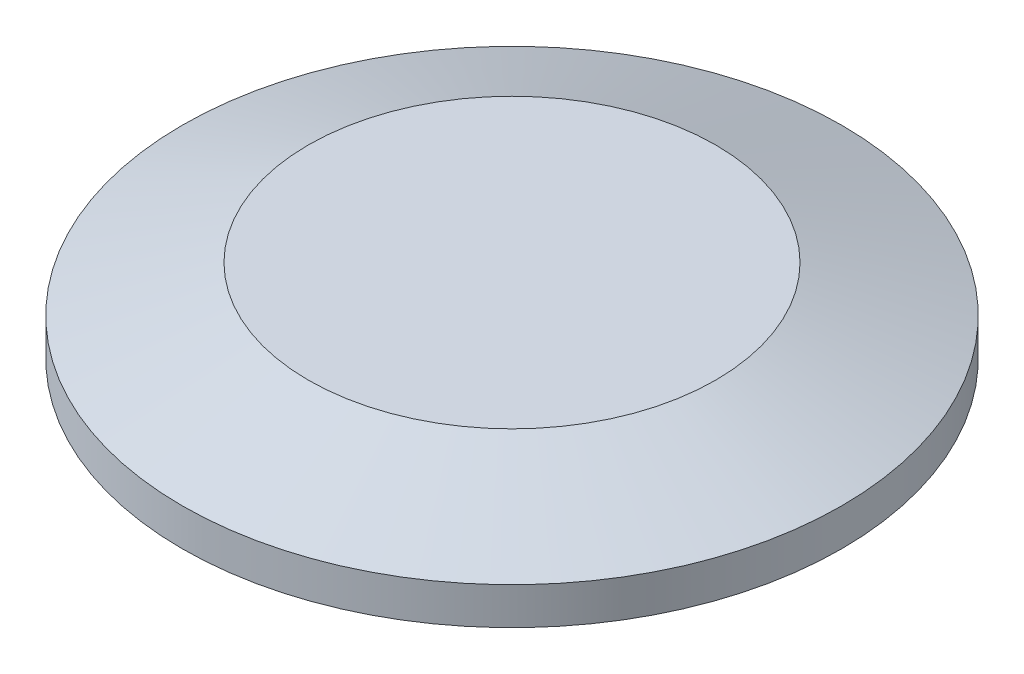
ISO-10303-21;
HEADER;
FILE_DESCRIPTION(('STEP AP214'),'2;1');
FILE_NAME('part.step','',(''),(''),'','','');
FILE_SCHEMA(('AUTOMOTIVE_DESIGN { 1 0 10303 214 1 1 1 1 }'));
ENDSEC;
DATA;
#1=APPLICATION_CONTEXT('core data for automotive mechanical design processes');
#2=APPLICATION_PROTOCOL_DEFINITION('international standard','automotive_design',2000,#1);
#3=PRODUCT_CONTEXT('',#1,'mechanical');
#4=PRODUCT('Part','Part','',(#3));
#5=PRODUCT_RELATED_PRODUCT_CATEGORY('part','',(#4));
#6=PRODUCT_DEFINITION_FORMATION('','',#4);
#7=PRODUCT_DEFINITION_CONTEXT('part definition',#1,'design');
#8=PRODUCT_DEFINITION('design','',#6,#7);
#9=PRODUCT_DEFINITION_SHAPE('','',#8);
#10=(LENGTH_UNIT() NAMED_UNIT(*) SI_UNIT(.MILLI.,.METRE.));
#11=(NAMED_UNIT(*) PLANE_ANGLE_UNIT() SI_UNIT($,.RADIAN.));
#12=(NAMED_UNIT(*) SI_UNIT($,.STERADIAN.) SOLID_ANGLE_UNIT());
#13=UNCERTAINTY_MEASURE_WITH_UNIT(LENGTH_MEASURE(1.E-05),#10,'distance_accuracy_value','');
#14=(GEOMETRIC_REPRESENTATION_CONTEXT(3) GLOBAL_UNCERTAINTY_ASSIGNED_CONTEXT((#13)) GLOBAL_UNIT_ASSIGNED_CONTEXT((#10,
#11,#12)) REPRESENTATION_CONTEXT('',''));
#15=CARTESIAN_POINT('',(0.,0.,0.));
#16=DIRECTION('',(0.,0.,1.));
#17=DIRECTION('',(1.,0.,0.));
#18=AXIS2_PLACEMENT_3D('',#15,#16,#17);
#19=CARTESIAN_POINT('',(-15.5663421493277,6.35,0.));
#20=DIRECTION('',(0.,1.,0.));
#21=DIRECTION('',(-1.,0.,0.));
#22=AXIS2_PLACEMENT_3D('',#19,#20,#21);
#23=PLANE('',#22);
#24=CARTESIAN_POINT('',(0.,6.35,0.));
#25=DIRECTION('',(0.,1.,0.));
#26=DIRECTION('',(-1.,0.,0.));
#27=AXIS2_PLACEMENT_3D('',#24,#25,#26);
#28=CIRCLE('',#27,15.5663421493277);
#29=CARTESIAN_POINT('',(-15.5663421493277,6.35,0.));
#30=VERTEX_POINT('',#29);
#31=EDGE_CURVE('E10',#30,#30,#28,.T.);
#32=ORIENTED_EDGE('',*,*,#31,.T.);
#33=EDGE_LOOP('',(#32));
#34=FACE_BOUND('',#33,.T.);
#35=ADVANCED_FACE('F31',(#34),#23,.T.);
#36=CARTESIAN_POINT('',(0.,6.35,0.));
#37=DIRECTION('',(0.,-1.,0.));
#38=DIRECTION('',(1.,0.,0.));
#39=AXIS2_PLACEMENT_3D('',#36,#37,#38);
#40=CONICAL_SURFACE('',#39,15.5663421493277,1.22173047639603);
#41=CARTESIAN_POINT('',(0.,2.8448,0.));
#42=DIRECTION('',(0.,1.,0.));
#43=DIRECTION('',(-1.,0.,0.));
#44=AXIS2_PLACEMENT_3D('',#41,#42,#43);
#45=CIRCLE('',#44,25.1968);
#46=CARTESIAN_POINT('',(-25.1968,2.8448,0.));
#47=VERTEX_POINT('',#46);
#48=EDGE_CURVE('E37',#47,#47,#45,.T.);
#49=ORIENTED_EDGE('',*,*,#48,.T.);
#50=EDGE_LOOP('',(#49));
#51=FACE_BOUND('',#50,.T.);
#52=ORIENTED_EDGE('',*,*,#31,.F.);
#53=EDGE_LOOP('',(#52));
#54=FACE_BOUND('',#53,.T.);
#55=ADVANCED_FACE('F72',(#51,#54),#40,.T.);
#56=CARTESIAN_POINT('',(0.,6.35,0.));
#57=DIRECTION('',(0.,1.,0.));
#58=DIRECTION('',(-1.,0.,0.));
#59=AXIS2_PLACEMENT_3D('',#56,#57,#58);
#60=CYLINDRICAL_SURFACE('',#59,25.1968);
#61=CARTESIAN_POINT('',(0.,0.,0.));
#62=DIRECTION('',(0.,1.,0.));
#63=DIRECTION('',(-1.,0.,0.));
#64=AXIS2_PLACEMENT_3D('',#61,#62,#63);
#65=CIRCLE('',#64,25.1968);
#66=CARTESIAN_POINT('',(-25.1968,0.,0.));
#67=VERTEX_POINT('',#66);
#68=EDGE_CURVE('E41',#67,#67,#65,.T.);
#69=ORIENTED_EDGE('',*,*,#68,.T.);
#70=EDGE_LOOP('',(#69));
#71=FACE_BOUND('',#70,.T.);
#72=ORIENTED_EDGE('',*,*,#48,.F.);
#73=EDGE_LOOP('',(#72));
#74=FACE_BOUND('',#73,.T.);
#75=ADVANCED_FACE('F76',(#71,#74),#60,.T.);
#76=CARTESIAN_POINT('',(-23.6366084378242,0.,0.));
#77=DIRECTION('',(0.,-1.,0.));
#78=DIRECTION('',(1.,0.,0.));
#79=AXIS2_PLACEMENT_3D('',#76,#77,#78);
#80=PLANE('',#79);
#81=CARTESIAN_POINT('',(0.,0.,0.));
#82=DIRECTION('',(0.,1.,0.));
#83=DIRECTION('',(-1.,0.,0.));
#84=AXIS2_PLACEMENT_3D('',#81,#82,#83);
#85=CIRCLE('',#84,23.6366084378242);
#86=CARTESIAN_POINT('',(-23.6366084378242,0.,0.));
#87=VERTEX_POINT('',#86);
#88=EDGE_CURVE('E45',#87,#87,#85,.T.);
#89=ORIENTED_EDGE('',*,*,#88,.T.);
#90=EDGE_LOOP('',(#89));
#91=FACE_BOUND('',#90,.T.);
#92=ORIENTED_EDGE('',*,*,#68,.F.);
#93=EDGE_LOOP('',(#92));
#94=FACE_BOUND('',#93,.T.);
#95=ADVANCED_FACE('F80',(#91,#94),#80,.T.);
#96=CARTESIAN_POINT('',(0.,0.787399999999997,0.));
#97=DIRECTION('',(0.,1.,0.));
#98=DIRECTION('',(-1.,0.,0.));
#99=AXIS2_PLACEMENT_3D('',#96,#97,#98);
#100=TOROIDAL_SURFACE('',#99,23.6366084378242,0.787399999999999);
#101=CARTESIAN_POINT('',(0.,0.474458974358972,0.));
#102=DIRECTION('',(0.,1.,0.));
#103=DIRECTION('',(-1.,0.,0.));
#104=AXIS2_PLACEMENT_3D('',#101,#102,#103);
#105=CIRCLE('',#104,22.9140666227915);
#106=CARTESIAN_POINT('',(-22.9140666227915,0.474458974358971,0.));
#107=VERTEX_POINT('',#106);
#108=EDGE_CURVE('E50',#107,#107,#105,.T.);
#109=ORIENTED_EDGE('',*,*,#108,.T.);
#110=EDGE_LOOP('',(#109));
#111=FACE_BOUND('',#110,.T.);
#112=ORIENTED_EDGE('',*,*,#88,.F.);
#113=EDGE_LOOP('',(#112));
#114=FACE_BOUND('',#113,.T.);
#115=ADVANCED_FACE('F87',(#111,#114),#100,.T.);
#116=CARTESIAN_POINT('',(0.,0.,0.));
#117=DIRECTION('',(0.,1.,0.));
#118=DIRECTION('',(-1.,0.,0.));
#119=AXIS2_PLACEMENT_3D('',#116,#117,#118);
#120=TOROIDAL_SURFACE('',#119,21.8186,1.1938);
#121=CARTESIAN_POINT('',(0.,0.474458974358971,0.));
#122=DIRECTION('',(0.,1.,0.));
#123=DIRECTION('',(-1.,0.,0.));
#124=AXIS2_PLACEMENT_3D('',#121,#122,#123);
#125=CIRCLE('',#124,20.7231333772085);
#126=CARTESIAN_POINT('',(-20.7231333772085,0.474458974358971,0.));
#127=VERTEX_POINT('',#126);
#128=EDGE_CURVE('E53',#127,#127,#125,.T.);
#129=ORIENTED_EDGE('',*,*,#128,.T.);
#130=EDGE_LOOP('',(#129));
#131=FACE_BOUND('',#130,.T.);
#132=ORIENTED_EDGE('',*,*,#108,.F.);
#133=EDGE_LOOP('',(#132));
#134=FACE_BOUND('',#133,.T.);
#135=ADVANCED_FACE('F69',(#131,#134),#120,.F.);
#136=CARTESIAN_POINT('',(0.,0.787399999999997,0.));
#137=DIRECTION('',(0.,1.,0.));
#138=DIRECTION('',(-1.,0.,0.));
#139=AXIS2_PLACEMENT_3D('',#136,#137,#138);
#140=TOROIDAL_SURFACE('',#139,20.0005915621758,0.787399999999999);
#141=CARTESIAN_POINT('',(0.,0.,0.));
#142=DIRECTION('',(0.,1.,0.));
#143=DIRECTION('',(-1.,0.,0.));
#144=AXIS2_PLACEMENT_3D('',#141,#142,#143);
#145=CIRCLE('',#144,20.0005915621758);
#146=CARTESIAN_POINT('',(-20.0005915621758,0.,0.));
#147=VERTEX_POINT('',#146);
#148=EDGE_CURVE('E56',#147,#147,#145,.T.);
#149=ORIENTED_EDGE('',*,*,#148,.T.);
#150=EDGE_LOOP('',(#149));
#151=FACE_BOUND('',#150,.T.);
#152=ORIENTED_EDGE('',*,*,#128,.F.);
#153=EDGE_LOOP('',(#152));
#154=FACE_BOUND('',#153,.T.);
#155=ADVANCED_FACE('F60',(#151,#154),#140,.T.);
#156=CARTESIAN_POINT('',(0.,0.,0.));
#157=DIRECTION('',(0.,-1.,0.));
#158=DIRECTION('',(1.,0.,0.));
#159=AXIS2_PLACEMENT_3D('',#156,#157,#158);
#160=PLANE('',#159);
#161=ORIENTED_EDGE('',*,*,#148,.F.);
#162=EDGE_LOOP('',(#161));
#163=FACE_BOUND('',#162,.T.);
#164=ADVANCED_FACE('F63',(#163),#160,.T.);
#165=CLOSED_SHELL('',(#35,#55,#75,#95,#115,#135,#155,#164));
#166=MANIFOLD_SOLID_BREP('B2',#165);
#167=ADVANCED_BREP_SHAPE_REPRESENTATION('',(#18,#166),#14);
#168=SHAPE_DEFINITION_REPRESENTATION(#9,#167);
ENDSEC;
END-ISO-10303-21;
